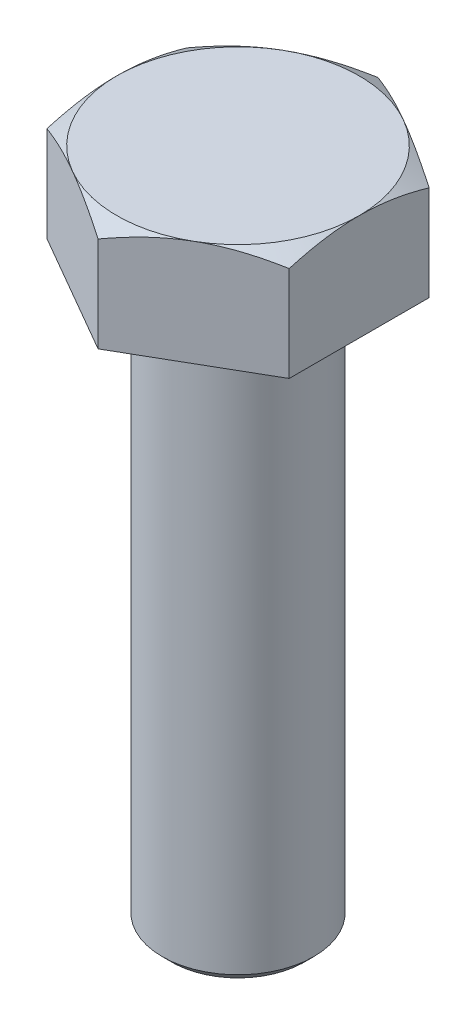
from build123d import *

# Parameters (mm, degrees)
BOSS_EXTRUDE1_DEPTH = 11.2
SKETCH2_R           = 8
BOSS_EXTRUDE2_DEPTH = 60
SKETCH3_OUTSIDE_W   = 279.406
SKETCH3_OUTSIDE_H   = 283.366
SKETCH3_OUTSIDE_R   = 12.8
CUT_EXTRUDE1_DEPTH  = 68
CUT_EXTRUDE1_DRAFT  = -60
SKETCH4_OUTSIDE_W   = 179.846
SKETCH4_OUTSIDE_H   = 183.806
SKETCH4_OUTSIDE_R   = 7
CUT_EXTRUDE2_DEPTH  = 68
CUT_EXTRUDE2_DRAFT  = -45


with BuildPart() as part:
    # Sketch1 → Boss-Extrude1 (new body)
    with BuildSketch(Plane(origin=(0, 0, 0), x_dir=(1, 0, 0), z_dir=(0, 1, 0))):
        Polygon((0, 14.780166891), (-12.8, 7.390083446), (-12.8, -7.390083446), (0, -14.780166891), (12.8, -7.390083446), (12.8, 7.390083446), align=None)
    extrude(amount=BOSS_EXTRUDE1_DEPTH)

    # Sketch2 → Boss-Extrude2 (add)
    with BuildSketch(Plane.XZ):
        with Locations(Location((0, 0, 0), (0, 0, 90))):
            Circle(SKETCH2_R)
    extrude(amount=BOSS_EXTRUDE2_DEPTH)


with BuildPart() as cut_extrude1_tool:
    # Sketch3 outside → Cut-Extrude1 (with draft: the straight prism first)
    with BuildSketch(Plane(origin=(0, 11.2, 0), x_dir=(1, 0, 0), z_dir=(0, 1, 0))):
        Rectangle(SKETCH3_OUTSIDE_W, SKETCH3_OUTSIDE_H)
        Circle(SKETCH3_OUTSIDE_R, mode=Mode.SUBTRACT)
    extrude(amount=-CUT_EXTRUDE1_DEPTH)
    # Cut-Extrude1: the draft: its side faces are tilted about the plane it starts from
    cut_extrude1_sides = [cut_extrude1_tool.faces().sort_by_distance(p)[0] for p in [
        (0, -22.8, 141.683),
        (139.703, -22.8, 0),
        (0, -22.8, -141.683),
        (-139.703, -22.8, 0),
        (-12.8, -22.8, 0),
    ]]
    draft(cut_extrude1_sides, Plane(origin=(0, 11.2, 0), x_dir=(1, 0, 0), z_dir=(0, 1, 0)), CUT_EXTRUDE1_DRAFT)


with BuildPart() as part_1:
    add(part.part)

    # Cut-Extrude1: cut by cut_extrude1_tool
    add(cut_extrude1_tool.part, mode=Mode.SUBTRACT)


with BuildPart() as cut_extrude2_tool:
    # Sketch4 outside → Cut-Extrude2 (with draft: the straight prism first)
    with BuildSketch(Plane.XZ.offset(60)):
        Rectangle(SKETCH4_OUTSIDE_W, SKETCH4_OUTSIDE_H)
        Circle(SKETCH4_OUTSIDE_R, mode=Mode.SUBTRACT)
    extrude(amount=-CUT_EXTRUDE2_DEPTH)
    # Cut-Extrude2: the draft: its side faces are tilted about the plane it starts from
    cut_extrude2_sides = [cut_extrude2_tool.faces().sort_by_distance(p)[0] for p in [
        (0, -26, -91.903),
        (89.923, -26, 0),
        (0, -26, 91.903),
        (-89.923, -26, 0),
        (-7, -26, 0),
    ]]
    draft(cut_extrude2_sides, Plane.XZ.offset(60), CUT_EXTRUDE2_DRAFT)


with BuildPart() as part_2:
    add(part_1.part)

    # Cut-Extrude2: cut by cut_extrude2_tool
    add(cut_extrude2_tool.part, mode=Mode.SUBTRACT)


solid = part_2.part
